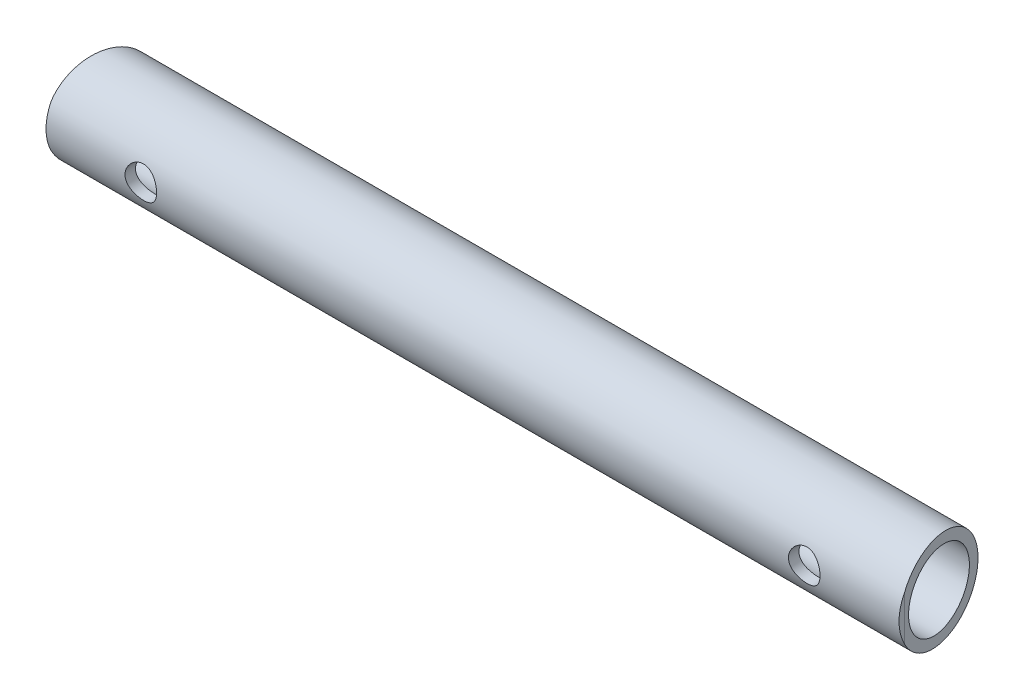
from build123d import *

# Parameters (mm, degrees)
SKETCH2_W          = 171.45
SKETCH2_H          = 2.1082
CUT_EXTRUDE5_DEPTH = 25.4
SKETCH5_R          = 3.175
CUT_EXTRUDE6_DEPTH = 25.4


with BuildPart() as part:
    # Sketch2 → Revolve1 (revolve)
    with BuildSketch(Plane.XY, mode=Mode.PRIVATE) as revolve1_sk:
        with Locations((0, 8.4709)):
            Rectangle(SKETCH2_W, SKETCH2_H)
    revolve(revolve1_sk.sketch.rotate(Axis((0, 0, 0), (1, 0, 0)), 90), axis=Axis((0, 0, 0), (1, 0, 0)))

    # Sketch4 → Cut-Extrude5 (cut, symmetric)
    with BuildSketch(Plane(origin=(0, 0, 0), x_dir=(1, 0, 0), z_dir=(0, 1, 0))):
        Polygon((-80.651200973, 20.32), (-84.234165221, 0), (-88.265, -22.86), (-88.265, 20.32), align=None)
        Polygon((84.234165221, 0), (80.651200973, 20.32), (88.265, 20.32), (88.265, -22.86), align=None)
    extrude(amount=CUT_EXTRUDE5_DEPTH, both=True, mode=Mode.SUBTRACT)

    # Sketch5 → Cut-Extrude6 (cut, symmetric)
    with BuildSketch(Plane.XY):
        with Locations((-66.675, 0)):
            Circle(SKETCH5_R)
        with Locations((66.675, 0)):
            Circle(SKETCH5_R)
    extrude(amount=CUT_EXTRUDE6_DEPTH, both=True, mode=Mode.SUBTRACT)


solid = part.part
